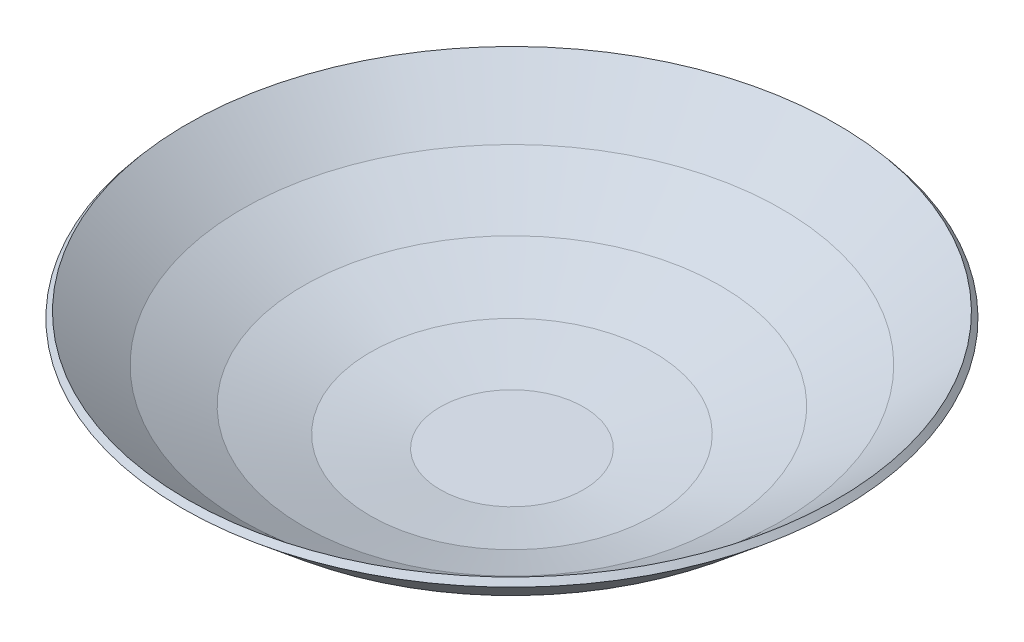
from build123d import *


with BuildPart() as part:
    # Sketch2 → Revolve1 (revolve)
    with BuildSketch(Plane.XY, mode=Mode.PRIVATE) as revolve1_sk:
        with BuildLine():
            Line((0, 1), (0, 0))
            Line((0, 0), (9.912511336, 0))
            ThreePointArc((9.912511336, 0), (9.999667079, 0.003805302), (10.086159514, 0.015192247))
            Line((10.086159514, 0.015192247), (19.761918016, 1.72128953))
            ThreePointArc((19.761918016, 1.72128953), (19.847088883, 1.740171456), (19.930289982, 1.766404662))
            Line((19.930289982, 1.766404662), (29.162791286, 5.126760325))
            ThreePointArc((29.162791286, 5.126760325), (29.243389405, 5.160145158), (29.320771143, 5.200427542))
            Line((29.320771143, 5.200427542), (37.829490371, 10.112938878))
            ThreePointArc((37.829490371, 10.112938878), (37.903066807, 10.159812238), (37.97227798, 10.212919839))
            Line((37.97227798, 10.212919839), (45.565702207, 16.584559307))
            Line((45.565702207, 16.584559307), (44.922914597, 17.35060375))
            Line((44.922914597, 17.35060375), (37.329490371, 10.978964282))
            Line((37.329490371, 10.978964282), (28.820771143, 6.066452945))
            Line((28.820771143, 6.066452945), (19.588269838, 2.706097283))
            Line((19.588269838, 2.706097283), (9.912511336, 1))
            Line((9.912511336, 1), (0, 1))
        make_face()
    revolve(revolve1_sk.sketch.rotate(Axis((0, 1, 0), (0, -1, 0)), 90), axis=Axis((0, 1, 0), (0, -1, 0)))


solid = part.part
